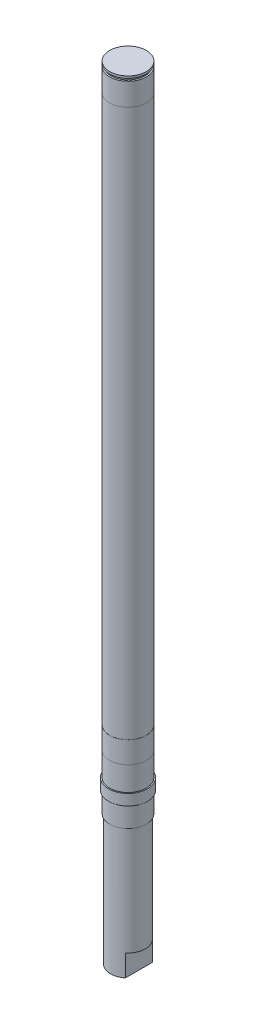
from build123d import *

# Parameters (mm, degrees)
ESQUISSE2_OUTSIDE_W   = 92.28
ESQUISSE2_OUTSIDE_H   = 92.28
ESQUISSE2_OUTSIDE_W_2 = 10
ESQUISSE2_OUTSIDE_H_2 = 24.610755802
EXTRUSION1_DEPTH      = 10


with BuildPart() as part:
    # Esquisse1 → R_volution1 (revolve)
    with BuildSketch(Plane.XY):
        Polygon((0, 0), (8, 0), (8, 60), (8.45, 60), (8.45, 69.4), (9, 69.4), (9, 74.4), (8.45, 74.4), (8.45, 85.5), (8.5, 85.5), (8.5, 95.5), (8.45, 95.5), (8.45, 348), (8.5, 348), (8.5, 358.4), (7.75, 358.4), (7.75, 359.5), (8.45, 359.5), (8.45, 360.5), (0, 360.5), align=None)
    revolve(axis=Axis((0, 0, 0), (0, 1, 0)))

    # Esquisse2 outside → Extrusion1 (cut)
    with BuildSketch(Plane.XZ):
        Rectangle(ESQUISSE2_OUTSIDE_W, ESQUISSE2_OUTSIDE_H)
        Rectangle(ESQUISSE2_OUTSIDE_W_2, ESQUISSE2_OUTSIDE_H_2, mode=Mode.SUBTRACT)
    extrude(amount=-EXTRUSION1_DEPTH, mode=Mode.SUBTRACT)


solid = part.part
